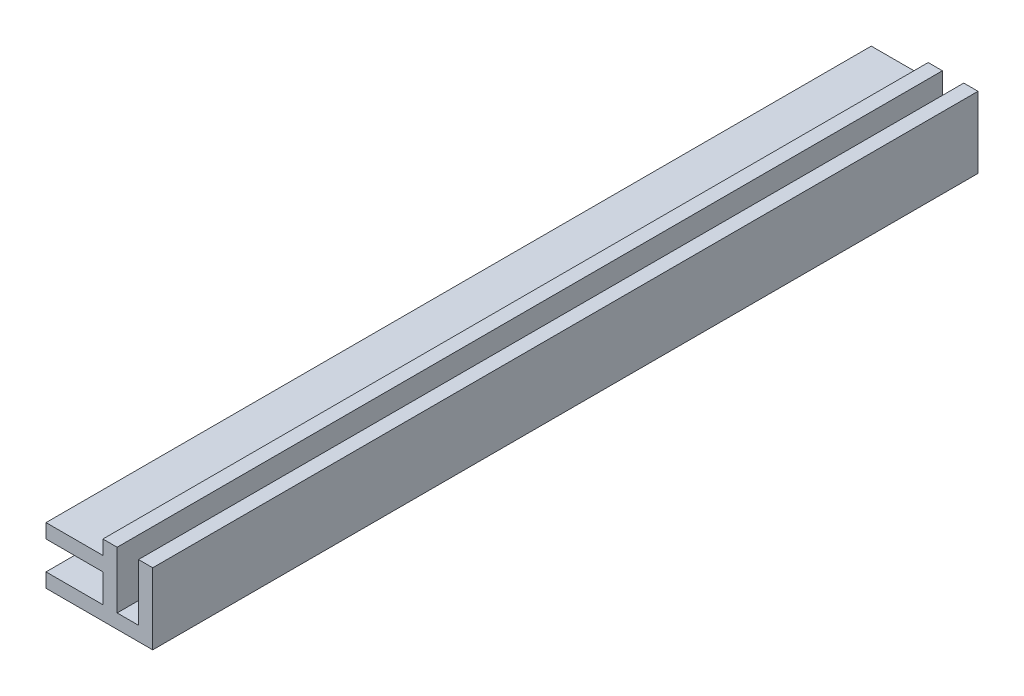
from build123d import *

# Parameters (mm, degrees)
ESQUISSE1_W             = 15
ESQUISSE1_H             = 10
EXTRUSION1_DEPTH        = 116
ESQUISSE2_W             = 8
ESQUISSE2_H             = 4
ENL_V_MAT_EXTRU_1_DEPTH = 118.39250402
ESQUISSE3_W             = 8
ESQUISSE3_H             = 2
ENL_V_MAT_EXTRU_2_DEPTH = 118.39250402
ESQUISSE4_W             = 3
ESQUISSE4_H             = 8
ENL_V_MAT_EXTRU_3_DEPTH = 118.39250402


with BuildPart() as part:
    # Esquisse1 → Extrusion1 (new body)
    with BuildSketch(Plane.XY):
        with Locations((7.5, 5)):
            Rectangle(ESQUISSE1_W, ESQUISSE1_H)
    extrude(amount=EXTRUSION1_DEPTH)

    # Esquisse2 → Enl_v. mat.-Extru.1 (cut, through all)
    with BuildSketch(Plane.XY.offset(116)):
        with Locations((4, 4)):
            Rectangle(ESQUISSE2_W, ESQUISSE2_H)
    extrude(amount=-ENL_V_MAT_EXTRU_1_DEPTH, mode=Mode.SUBTRACT)

    # Esquisse3 → Enl_v. mat.-Extru.2 (cut, through all)
    with BuildSketch(Plane.XY.offset(116)):
        with Locations((4, 9)):
            Rectangle(ESQUISSE3_W, ESQUISSE3_H)
    extrude(amount=-ENL_V_MAT_EXTRU_2_DEPTH, mode=Mode.SUBTRACT)

    # Esquisse4 → Enl_v. mat.-Extru.3 (cut, through all)
    with BuildSketch(Plane.XY.offset(116)):
        with Locations((11.5, 6)):
            Rectangle(ESQUISSE4_W, ESQUISSE4_H)
    extrude(amount=-ENL_V_MAT_EXTRU_3_DEPTH, mode=Mode.SUBTRACT)


solid = part.part
